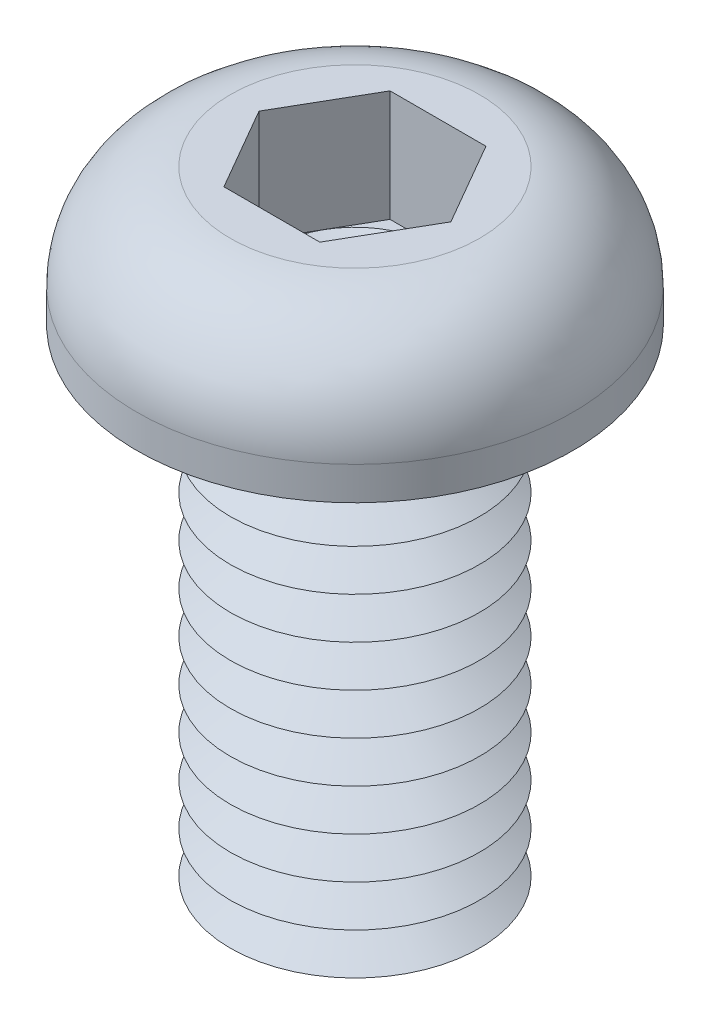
ISO-10303-21;
HEADER;
FILE_DESCRIPTION(('STEP AP214'),'2;1');
FILE_NAME('part.step','',(''),(''),'','','');
FILE_SCHEMA(('AUTOMOTIVE_DESIGN { 1 0 10303 214 1 1 1 1 }'));
ENDSEC;
DATA;
#1=APPLICATION_CONTEXT('core data for automotive mechanical design processes');
#2=APPLICATION_PROTOCOL_DEFINITION('international standard','automotive_design',2000,#1);
#3=PRODUCT_CONTEXT('',#1,'mechanical');
#4=PRODUCT('Part','Part','',(#3));
#5=PRODUCT_RELATED_PRODUCT_CATEGORY('part','',(#4));
#6=PRODUCT_DEFINITION_FORMATION('','',#4);
#7=PRODUCT_DEFINITION_CONTEXT('part definition',#1,'design');
#8=PRODUCT_DEFINITION('design','',#6,#7);
#9=PRODUCT_DEFINITION_SHAPE('','',#8);
#10=(LENGTH_UNIT() NAMED_UNIT(*) SI_UNIT(.MILLI.,.METRE.));
#11=(NAMED_UNIT(*) PLANE_ANGLE_UNIT() SI_UNIT($,.RADIAN.));
#12=(NAMED_UNIT(*) SI_UNIT($,.STERADIAN.) SOLID_ANGLE_UNIT());
#13=UNCERTAINTY_MEASURE_WITH_UNIT(LENGTH_MEASURE(1.E-05),#10,'distance_accuracy_value','');
#14=(GEOMETRIC_REPRESENTATION_CONTEXT(3) GLOBAL_UNCERTAINTY_ASSIGNED_CONTEXT((#13)) GLOBAL_UNIT_ASSIGNED_CONTEXT((#10,
#11,#12)) REPRESENTATION_CONTEXT('',''));
#15=CARTESIAN_POINT('',(0.,0.,0.));
#16=DIRECTION('',(0.,0.,1.));
#17=DIRECTION('',(1.,0.,0.));
#18=AXIS2_PLACEMENT_3D('',#15,#16,#17);
#19=CARTESIAN_POINT('',(0.,0.,0.));
#20=DIRECTION('',(0.,-1.,0.));
#21=DIRECTION('',(0.,0.,-1.));
#22=AXIS2_PLACEMENT_3D('',#19,#20,#21);
#23=TOROIDAL_SURFACE('',#22,3.5,0.5);
#24=CARTESIAN_POINT('',(0.,0.,-4.));
#25=VERTEX_POINT('',#24);
#26=VERTEX_LOOP('',#25);
#27=FACE_BOUND('',#26,.T.);
#28=ADVANCED_FACE('P0_F12',(#27),#23,.T.);
#29=CLOSED_SHELL('',(#28));
#30=MANIFOLD_SOLID_BREP('P0_B1',#29);
#31=CARTESIAN_POINT('',(1.15470053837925,0.62,-2.));
#32=DIRECTION('',(0.,1.,0.));
#33=DIRECTION('',(0.,0.,1.));
#34=AXIS2_PLACEMENT_3D('',#31,#32,#33);
#35=PLANE('',#34);
#36=CARTESIAN_POINT('',(0.,0.62,0.));
#37=DIRECTION('',(0.,1.,0.));
#38=DIRECTION('',(0.,0.,1.));
#39=AXIS2_PLACEMENT_3D('',#36,#37,#38);
#40=CIRCLE('',#39,2.);
#41=CARTESIAN_POINT('',(0.,0.62,2.));
#42=VERTEX_POINT('',#41);
#43=CARTESIAN_POINT('',(1.73205080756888,0.62,1.));
#44=VERTEX_POINT('',#43);
#45=EDGE_CURVE('P1_E93',#42,#44,#40,.T.);
#46=ORIENTED_EDGE('',*,*,#45,.F.);
#47=DIRECTION('',(1.,0.,0.));
#48=VECTOR('',#47,1.);
#49=CARTESIAN_POINT('',(-1.15470053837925,0.62,2.));
#50=LINE('',#49,#48);
#51=CARTESIAN_POINT('',(1.15470053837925,0.62,2.));
#52=VERTEX_POINT('',#51);
#53=EDGE_CURVE('P1_E116',#42,#52,#50,.T.);
#54=ORIENTED_EDGE('',*,*,#53,.T.);
#55=DIRECTION('',(0.5,0.,-0.866025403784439));
#56=VECTOR('',#55,1.);
#57=CARTESIAN_POINT('',(1.15470053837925,0.62,2.));
#58=LINE('',#57,#56);
#59=EDGE_CURVE('P1_E112',#52,#44,#58,.T.);
#60=ORIENTED_EDGE('',*,*,#59,.T.);
#61=EDGE_LOOP('',(#46,#54,#60));
#62=FACE_BOUND('',#61,.T.);
#63=ADVANCED_FACE('P1_F15',(#62),#35,.T.);
#64=CARTESIAN_POINT('',(0.,0.62,0.));
#65=DIRECTION('',(0.,1.,0.));
#66=DIRECTION('',(0.,0.,1.));
#67=AXIS2_PLACEMENT_3D('',#64,#65,#66);
#68=CIRCLE('',#67,2.);
#69=CARTESIAN_POINT('',(1.73205080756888,0.62,-1.));
#70=VERTEX_POINT('',#69);
#71=EDGE_CURVE('P1_E10',#44,#70,#68,.T.);
#72=ORIENTED_EDGE('',*,*,#71,.F.);
#73=CARTESIAN_POINT('',(2.3094010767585,0.62,0.));
#74=VERTEX_POINT('',#73);
#75=EDGE_CURVE('P1_E104',#44,#74,#58,.T.);
#76=ORIENTED_EDGE('',*,*,#75,.T.);
#77=DIRECTION('',(-0.5,0.,-0.866025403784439));
#78=VECTOR('',#77,1.);
#79=CARTESIAN_POINT('',(2.3094010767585,0.62,0.));
#80=LINE('',#79,#78);
#81=EDGE_CURVE('P1_E107',#74,#70,#80,.T.);
#82=ORIENTED_EDGE('',*,*,#81,.T.);
#83=EDGE_LOOP('',(#72,#76,#82));
#84=FACE_BOUND('',#83,.T.);
#85=ADVANCED_FACE('P1_F103',(#84),#35,.T.);
#86=CARTESIAN_POINT('',(0.,0.62,-2.));
#87=VERTEX_POINT('',#86);
#88=EDGE_CURVE('P1_E24',#70,#87,#68,.T.);
#89=ORIENTED_EDGE('',*,*,#88,.F.);
#90=CARTESIAN_POINT('',(1.15470053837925,0.62,-2.));
#91=VERTEX_POINT('',#90);
#92=EDGE_CURVE('P1_E139',#70,#91,#80,.T.);
#93=ORIENTED_EDGE('',*,*,#92,.T.);
#94=DIRECTION('',(-1.,0.,0.));
#95=VECTOR('',#94,1.);
#96=CARTESIAN_POINT('',(1.15470053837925,0.62,-2.));
#97=LINE('',#96,#95);
#98=EDGE_CURVE('P1_E288',#91,#87,#97,.T.);
#99=ORIENTED_EDGE('',*,*,#98,.T.);
#100=EDGE_LOOP('',(#89,#93,#99));
#101=FACE_BOUND('',#100,.T.);
#102=ADVANCED_FACE('P1_F253',(#101),#35,.T.);
#103=CARTESIAN_POINT('',(-1.73205080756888,0.62,-1.));
#104=VERTEX_POINT('',#103);
#105=EDGE_CURVE('P1_E283',#87,#104,#68,.T.);
#106=ORIENTED_EDGE('',*,*,#105,.F.);
#107=CARTESIAN_POINT('',(-1.15470053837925,0.62,-2.));
#108=VERTEX_POINT('',#107);
#109=EDGE_CURVE('P1_E292',#87,#108,#97,.T.);
#110=ORIENTED_EDGE('',*,*,#109,.T.);
#111=DIRECTION('',(-0.5,0.,0.866025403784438));
#112=VECTOR('',#111,1.);
#113=CARTESIAN_POINT('',(-1.15470053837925,0.62,-2.));
#114=LINE('',#113,#112);
#115=EDGE_CURVE('P1_E287',#108,#104,#114,.T.);
#116=ORIENTED_EDGE('',*,*,#115,.T.);
#117=EDGE_LOOP('',(#106,#110,#116));
#118=FACE_BOUND('',#117,.T.);
#119=ADVANCED_FACE('P1_F267',(#118),#35,.T.);
#120=CARTESIAN_POINT('',(-1.73205080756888,0.62,1.));
#121=VERTEX_POINT('',#120);
#122=EDGE_CURVE('P1_E31',#104,#121,#68,.T.);
#123=ORIENTED_EDGE('',*,*,#122,.F.);
#124=CARTESIAN_POINT('',(-2.3094010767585,0.62,0.));
#125=VERTEX_POINT('',#124);
#126=EDGE_CURVE('P1_E279',#104,#125,#114,.T.);
#127=ORIENTED_EDGE('',*,*,#126,.T.);
#128=DIRECTION('',(0.5,0.,0.866025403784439));
#129=VECTOR('',#128,1.);
#130=CARTESIAN_POINT('',(-2.3094010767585,0.62,0.));
#131=LINE('',#130,#129);
#132=EDGE_CURVE('P1_E282',#125,#121,#131,.T.);
#133=ORIENTED_EDGE('',*,*,#132,.T.);
#134=EDGE_LOOP('',(#123,#127,#133));
#135=FACE_BOUND('',#134,.T.);
#136=ADVANCED_FACE('P1_F258',(#135),#35,.T.);
#137=CARTESIAN_POINT('',(0.,-11.,0.));
#138=DIRECTION('',(0.,1.,0.));
#139=DIRECTION('',(0.,0.,1.));
#140=AXIS2_PLACEMENT_3D('',#137,#138,#139);
#141=CONICAL_SURFACE('',#140,2.13397459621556,1.0471975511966);
#142=CARTESIAN_POINT('',(0.,-10.5,0.));
#143=DIRECTION('',(0.,-1.,0.));
#144=DIRECTION('',(0.,0.,-1.));
#145=AXIS2_PLACEMENT_3D('',#142,#143,#144);
#146=CIRCLE('',#145,3.);
#147=CARTESIAN_POINT('',(0.,-10.5,-3.));
#148=VERTEX_POINT('',#147);
#149=EDGE_CURVE('P1_E215',#148,#148,#146,.T.);
#150=ORIENTED_EDGE('',*,*,#149,.T.);
#151=EDGE_LOOP('',(#150));
#152=FACE_BOUND('',#151,.T.);
#153=CARTESIAN_POINT('',(0.,-11.,0.));
#154=DIRECTION('',(0.,-1.,0.));
#155=DIRECTION('',(0.,0.,-1.));
#156=AXIS2_PLACEMENT_3D('',#153,#154,#155);
#157=CIRCLE('',#156,2.13397459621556);
#158=CARTESIAN_POINT('',(0.,-11.,-2.13397459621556));
#159=VERTEX_POINT('',#158);
#160=EDGE_CURVE('P1_E218',#159,#159,#157,.T.);
#161=ORIENTED_EDGE('',*,*,#160,.F.);
#162=EDGE_LOOP('',(#161));
#163=FACE_BOUND('',#162,.T.);
#164=ADVANCED_FACE('P1_F266',(#152,#163),#141,.T.);
#165=CARTESIAN_POINT('',(0.,-11.5,0.));
#166=DIRECTION('',(0.,-1.,0.));
#167=DIRECTION('',(0.,0.,-1.));
#168=AXIS2_PLACEMENT_3D('',#165,#166,#167);
#169=CONICAL_SURFACE('',#168,3.,1.0471975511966);
#170=ORIENTED_EDGE('',*,*,#160,.T.);
#171=EDGE_LOOP('',(#170));
#172=FACE_BOUND('',#171,.T.);
#173=CARTESIAN_POINT('',(0.,-11.5,0.));
#174=DIRECTION('',(0.,-1.,0.));
#175=DIRECTION('',(0.,0.,-1.));
#176=AXIS2_PLACEMENT_3D('',#173,#174,#175);
#177=CIRCLE('',#176,3.);
#178=CARTESIAN_POINT('',(0.,-11.5,-3.));
#179=VERTEX_POINT('',#178);
#180=EDGE_CURVE('P1_E221',#179,#179,#177,.T.);
#181=ORIENTED_EDGE('',*,*,#180,.F.);
#182=EDGE_LOOP('',(#181));
#183=FACE_BOUND('',#182,.T.);
#184=ADVANCED_FACE('P1_F273',(#172,#183),#169,.T.);
#185=CARTESIAN_POINT('',(0.,-12.,0.));
#186=DIRECTION('',(0.,1.,0.));
#187=DIRECTION('',(0.,0.,1.));
#188=AXIS2_PLACEMENT_3D('',#185,#186,#187);
#189=PLANE('',#188);
#190=CARTESIAN_POINT('',(0.,-12.,0.));
#191=DIRECTION('',(0.,-1.,0.));
#192=DIRECTION('',(0.,0.,-1.));
#193=AXIS2_PLACEMENT_3D('',#190,#191,#192);
#194=CIRCLE('',#193,2.13397459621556);
#195=CARTESIAN_POINT('',(0.,-12.,-2.13397459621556));
#196=VERTEX_POINT('',#195);
#197=EDGE_CURVE('P1_E224',#196,#196,#194,.T.);
#198=ORIENTED_EDGE('',*,*,#197,.T.);
#199=EDGE_LOOP('',(#198));
#200=FACE_BOUND('',#199,.T.);
#201=ADVANCED_FACE('P1_F351',(#200),#189,.F.);
#202=CARTESIAN_POINT('',(0.,-12.,0.));
#203=DIRECTION('',(0.,1.,0.));
#204=DIRECTION('',(0.,0.,1.));
#205=AXIS2_PLACEMENT_3D('',#202,#203,#204);
#206=CONICAL_SURFACE('',#205,2.13397459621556,1.0471975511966);
#207=ORIENTED_EDGE('',*,*,#180,.T.);
#208=EDGE_LOOP('',(#207));
#209=FACE_BOUND('',#208,.T.);
#210=ORIENTED_EDGE('',*,*,#197,.F.);
#211=EDGE_LOOP('',(#210));
#212=FACE_BOUND('',#211,.T.);
#213=ADVANCED_FACE('P1_F362',(#209,#212),#206,.T.);
#214=CARTESIAN_POINT('',(0.,-10.,0.));
#215=DIRECTION('',(0.,1.,0.));
#216=DIRECTION('',(0.,0.,1.));
#217=AXIS2_PLACEMENT_3D('',#214,#215,#216);
#218=CONICAL_SURFACE('',#217,2.13397459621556,1.0471975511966);
#219=CARTESIAN_POINT('',(0.,-9.5,0.));
#220=DIRECTION('',(0.,-1.,0.));
#221=DIRECTION('',(0.,0.,-1.));
#222=AXIS2_PLACEMENT_3D('',#219,#220,#221);
#223=CIRCLE('',#222,3.);
#224=CARTESIAN_POINT('',(0.,-9.5,-3.));
#225=VERTEX_POINT('',#224);
#226=EDGE_CURVE('P1_E209',#225,#225,#223,.T.);
#227=ORIENTED_EDGE('',*,*,#226,.T.);
#228=EDGE_LOOP('',(#227));
#229=FACE_BOUND('',#228,.T.);
#230=CARTESIAN_POINT('',(0.,-10.,0.));
#231=DIRECTION('',(0.,-1.,0.));
#232=DIRECTION('',(0.,0.,-1.));
#233=AXIS2_PLACEMENT_3D('',#230,#231,#232);
#234=CIRCLE('',#233,2.13397459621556);
#235=CARTESIAN_POINT('',(0.,-10.,-2.13397459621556));
#236=VERTEX_POINT('',#235);
#237=EDGE_CURVE('P1_E212',#236,#236,#234,.T.);
#238=ORIENTED_EDGE('',*,*,#237,.F.);
#239=EDGE_LOOP('',(#238));
#240=FACE_BOUND('',#239,.T.);
#241=ADVANCED_FACE('P1_F371',(#229,#240),#218,.T.);
#242=CARTESIAN_POINT('',(0.,-10.5,0.));
#243=DIRECTION('',(0.,-1.,0.));
#244=DIRECTION('',(0.,0.,-1.));
#245=AXIS2_PLACEMENT_3D('',#242,#243,#244);
#246=CONICAL_SURFACE('',#245,3.,1.0471975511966);
#247=ORIENTED_EDGE('',*,*,#237,.T.);
#248=EDGE_LOOP('',(#247));
#249=FACE_BOUND('',#248,.T.);
#250=ORIENTED_EDGE('',*,*,#149,.F.);
#251=EDGE_LOOP('',(#250));
#252=FACE_BOUND('',#251,.T.);
#253=ADVANCED_FACE('P1_F380',(#249,#252),#246,.T.);
#254=CARTESIAN_POINT('',(0.,-9.,0.));
#255=DIRECTION('',(0.,1.,0.));
#256=DIRECTION('',(0.,0.,1.));
#257=AXIS2_PLACEMENT_3D('',#254,#255,#256);
#258=CONICAL_SURFACE('',#257,2.13397459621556,1.0471975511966);
#259=CARTESIAN_POINT('',(0.,-8.5,0.));
#260=DIRECTION('',(0.,-1.,0.));
#261=DIRECTION('',(0.,0.,-1.));
#262=AXIS2_PLACEMENT_3D('',#259,#260,#261);
#263=CIRCLE('',#262,3.);
#264=CARTESIAN_POINT('',(0.,-8.5,-3.));
#265=VERTEX_POINT('',#264);
#266=EDGE_CURVE('P1_E203',#265,#265,#263,.T.);
#267=ORIENTED_EDGE('',*,*,#266,.T.);
#268=EDGE_LOOP('',(#267));
#269=FACE_BOUND('',#268,.T.);
#270=CARTESIAN_POINT('',(0.,-9.,0.));
#271=DIRECTION('',(0.,-1.,0.));
#272=DIRECTION('',(0.,0.,-1.));
#273=AXIS2_PLACEMENT_3D('',#270,#271,#272);
#274=CIRCLE('',#273,2.13397459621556);
#275=CARTESIAN_POINT('',(0.,-9.,-2.13397459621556));
#276=VERTEX_POINT('',#275);
#277=EDGE_CURVE('P1_E206',#276,#276,#274,.T.);
#278=ORIENTED_EDGE('',*,*,#277,.F.);
#279=EDGE_LOOP('',(#278));
#280=FACE_BOUND('',#279,.T.);
#281=ADVANCED_FACE('P1_F390',(#269,#280),#258,.T.);
#282=CARTESIAN_POINT('',(0.,-9.5,0.));
#283=DIRECTION('',(0.,-1.,0.));
#284=DIRECTION('',(0.,0.,-1.));
#285=AXIS2_PLACEMENT_3D('',#282,#283,#284);
#286=CONICAL_SURFACE('',#285,3.,1.0471975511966);
#287=ORIENTED_EDGE('',*,*,#277,.T.);
#288=EDGE_LOOP('',(#287));
#289=FACE_BOUND('',#288,.T.);
#290=ORIENTED_EDGE('',*,*,#226,.F.);
#291=EDGE_LOOP('',(#290));
#292=FACE_BOUND('',#291,.T.);
#293=ADVANCED_FACE('P1_F400',(#289,#292),#286,.T.);
#294=CARTESIAN_POINT('',(0.,-8.,0.));
#295=DIRECTION('',(0.,1.,0.));
#296=DIRECTION('',(0.,0.,1.));
#297=AXIS2_PLACEMENT_3D('',#294,#295,#296);
#298=CONICAL_SURFACE('',#297,2.13397459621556,1.0471975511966);
#299=CARTESIAN_POINT('',(0.,-7.5,0.));
#300=DIRECTION('',(0.,-1.,0.));
#301=DIRECTION('',(0.,0.,-1.));
#302=AXIS2_PLACEMENT_3D('',#299,#300,#301);
#303=CIRCLE('',#302,3.);
#304=CARTESIAN_POINT('',(0.,-7.5,-3.));
#305=VERTEX_POINT('',#304);
#306=EDGE_CURVE('P1_E197',#305,#305,#303,.T.);
#307=ORIENTED_EDGE('',*,*,#306,.T.);
#308=EDGE_LOOP('',(#307));
#309=FACE_BOUND('',#308,.T.);
#310=CARTESIAN_POINT('',(0.,-8.,0.));
#311=DIRECTION('',(0.,-1.,0.));
#312=DIRECTION('',(0.,0.,-1.));
#313=AXIS2_PLACEMENT_3D('',#310,#311,#312);
#314=CIRCLE('',#313,2.13397459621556);
#315=CARTESIAN_POINT('',(0.,-8.,-2.13397459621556));
#316=VERTEX_POINT('',#315);
#317=EDGE_CURVE('P1_E200',#316,#316,#314,.T.);
#318=ORIENTED_EDGE('',*,*,#317,.F.);
#319=EDGE_LOOP('',(#318));
#320=FACE_BOUND('',#319,.T.);
#321=ADVANCED_FACE('P1_F410',(#309,#320),#298,.T.);
#322=CARTESIAN_POINT('',(0.,-8.5,0.));
#323=DIRECTION('',(0.,-1.,0.));
#324=DIRECTION('',(0.,0.,-1.));
#325=AXIS2_PLACEMENT_3D('',#322,#323,#324);
#326=CONICAL_SURFACE('',#325,3.,1.0471975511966);
#327=ORIENTED_EDGE('',*,*,#317,.T.);
#328=EDGE_LOOP('',(#327));
#329=FACE_BOUND('',#328,.T.);
#330=ORIENTED_EDGE('',*,*,#266,.F.);
#331=EDGE_LOOP('',(#330));
#332=FACE_BOUND('',#331,.T.);
#333=ADVANCED_FACE('P1_F420',(#329,#332),#326,.T.);
#334=CARTESIAN_POINT('',(0.,-7.,0.));
#335=DIRECTION('',(0.,1.,0.));
#336=DIRECTION('',(0.,0.,1.));
#337=AXIS2_PLACEMENT_3D('',#334,#335,#336);
#338=CONICAL_SURFACE('',#337,2.13397459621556,1.0471975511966);
#339=CARTESIAN_POINT('',(0.,-6.5,0.));
#340=DIRECTION('',(0.,-1.,0.));
#341=DIRECTION('',(0.,0.,-1.));
#342=AXIS2_PLACEMENT_3D('',#339,#340,#341);
#343=CIRCLE('',#342,3.);
#344=CARTESIAN_POINT('',(0.,-6.5,-3.));
#345=VERTEX_POINT('',#344);
#346=EDGE_CURVE('P1_E191',#345,#345,#343,.T.);
#347=ORIENTED_EDGE('',*,*,#346,.T.);
#348=EDGE_LOOP('',(#347));
#349=FACE_BOUND('',#348,.T.);
#350=CARTESIAN_POINT('',(0.,-7.,0.));
#351=DIRECTION('',(0.,-1.,0.));
#352=DIRECTION('',(0.,0.,-1.));
#353=AXIS2_PLACEMENT_3D('',#350,#351,#352);
#354=CIRCLE('',#353,2.13397459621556);
#355=CARTESIAN_POINT('',(0.,-7.,-2.13397459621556));
#356=VERTEX_POINT('',#355);
#357=EDGE_CURVE('P1_E194',#356,#356,#354,.T.);
#358=ORIENTED_EDGE('',*,*,#357,.F.);
#359=EDGE_LOOP('',(#358));
#360=FACE_BOUND('',#359,.T.);
#361=ADVANCED_FACE('P1_F430',(#349,#360),#338,.T.);
#362=CARTESIAN_POINT('',(0.,-7.5,0.));
#363=DIRECTION('',(0.,-1.,0.));
#364=DIRECTION('',(0.,0.,-1.));
#365=AXIS2_PLACEMENT_3D('',#362,#363,#364);
#366=CONICAL_SURFACE('',#365,3.,1.0471975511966);
#367=ORIENTED_EDGE('',*,*,#357,.T.);
#368=EDGE_LOOP('',(#367));
#369=FACE_BOUND('',#368,.T.);
#370=ORIENTED_EDGE('',*,*,#306,.F.);
#371=EDGE_LOOP('',(#370));
#372=FACE_BOUND('',#371,.T.);
#373=ADVANCED_FACE('P1_F440',(#369,#372),#366,.T.);
#374=CARTESIAN_POINT('',(0.,-6.,0.));
#375=DIRECTION('',(0.,1.,0.));
#376=DIRECTION('',(0.,0.,1.));
#377=AXIS2_PLACEMENT_3D('',#374,#375,#376);
#378=CONICAL_SURFACE('',#377,2.13397459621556,1.0471975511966);
#379=CARTESIAN_POINT('',(0.,-5.5,0.));
#380=DIRECTION('',(0.,-1.,0.));
#381=DIRECTION('',(0.,0.,-1.));
#382=AXIS2_PLACEMENT_3D('',#379,#380,#381);
#383=CIRCLE('',#382,3.);
#384=CARTESIAN_POINT('',(0.,-5.5,-3.));
#385=VERTEX_POINT('',#384);
#386=EDGE_CURVE('P1_E185',#385,#385,#383,.T.);
#387=ORIENTED_EDGE('',*,*,#386,.T.);
#388=EDGE_LOOP('',(#387));
#389=FACE_BOUND('',#388,.T.);
#390=CARTESIAN_POINT('',(0.,-6.,0.));
#391=DIRECTION('',(0.,-1.,0.));
#392=DIRECTION('',(0.,0.,-1.));
#393=AXIS2_PLACEMENT_3D('',#390,#391,#392);
#394=CIRCLE('',#393,2.13397459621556);
#395=CARTESIAN_POINT('',(0.,-6.,-2.13397459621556));
#396=VERTEX_POINT('',#395);
#397=EDGE_CURVE('P1_E188',#396,#396,#394,.T.);
#398=ORIENTED_EDGE('',*,*,#397,.F.);
#399=EDGE_LOOP('',(#398));
#400=FACE_BOUND('',#399,.T.);
#401=ADVANCED_FACE('P1_F450',(#389,#400),#378,.T.);
#402=CARTESIAN_POINT('',(0.,-6.5,0.));
#403=DIRECTION('',(0.,-1.,0.));
#404=DIRECTION('',(0.,0.,-1.));
#405=AXIS2_PLACEMENT_3D('',#402,#403,#404);
#406=CONICAL_SURFACE('',#405,3.,1.0471975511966);
#407=ORIENTED_EDGE('',*,*,#397,.T.);
#408=EDGE_LOOP('',(#407));
#409=FACE_BOUND('',#408,.T.);
#410=ORIENTED_EDGE('',*,*,#346,.F.);
#411=EDGE_LOOP('',(#410));
#412=FACE_BOUND('',#411,.T.);
#413=ADVANCED_FACE('P1_F460',(#409,#412),#406,.T.);
#414=CARTESIAN_POINT('',(0.,-5.,0.));
#415=DIRECTION('',(0.,1.,0.));
#416=DIRECTION('',(0.,0.,1.));
#417=AXIS2_PLACEMENT_3D('',#414,#415,#416);
#418=CONICAL_SURFACE('',#417,2.13397459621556,1.0471975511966);
#419=CARTESIAN_POINT('',(0.,-4.5,0.));
#420=DIRECTION('',(0.,-1.,0.));
#421=DIRECTION('',(0.,0.,-1.));
#422=AXIS2_PLACEMENT_3D('',#419,#420,#421);
#423=CIRCLE('',#422,3.);
#424=CARTESIAN_POINT('',(0.,-4.5,-3.));
#425=VERTEX_POINT('',#424);
#426=EDGE_CURVE('P1_E179',#425,#425,#423,.T.);
#427=ORIENTED_EDGE('',*,*,#426,.T.);
#428=EDGE_LOOP('',(#427));
#429=FACE_BOUND('',#428,.T.);
#430=CARTESIAN_POINT('',(0.,-5.,0.));
#431=DIRECTION('',(0.,-1.,0.));
#432=DIRECTION('',(0.,0.,-1.));
#433=AXIS2_PLACEMENT_3D('',#430,#431,#432);
#434=CIRCLE('',#433,2.13397459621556);
#435=CARTESIAN_POINT('',(0.,-5.,-2.13397459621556));
#436=VERTEX_POINT('',#435);
#437=EDGE_CURVE('P1_E182',#436,#436,#434,.T.);
#438=ORIENTED_EDGE('',*,*,#437,.F.);
#439=EDGE_LOOP('',(#438));
#440=FACE_BOUND('',#439,.T.);
#441=ADVANCED_FACE('P1_F470',(#429,#440),#418,.T.);
#442=CARTESIAN_POINT('',(0.,-5.5,0.));
#443=DIRECTION('',(0.,-1.,0.));
#444=DIRECTION('',(0.,0.,-1.));
#445=AXIS2_PLACEMENT_3D('',#442,#443,#444);
#446=CONICAL_SURFACE('',#445,3.,1.0471975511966);
#447=ORIENTED_EDGE('',*,*,#437,.T.);
#448=EDGE_LOOP('',(#447));
#449=FACE_BOUND('',#448,.T.);
#450=ORIENTED_EDGE('',*,*,#386,.F.);
#451=EDGE_LOOP('',(#450));
#452=FACE_BOUND('',#451,.T.);
#453=ADVANCED_FACE('P1_F480',(#449,#452),#446,.T.);
#454=CARTESIAN_POINT('',(0.,-4.,0.));
#455=DIRECTION('',(0.,1.,0.));
#456=DIRECTION('',(0.,0.,1.));
#457=AXIS2_PLACEMENT_3D('',#454,#455,#456);
#458=CONICAL_SURFACE('',#457,2.13397459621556,1.0471975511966);
#459=CARTESIAN_POINT('',(0.,-3.5,0.));
#460=DIRECTION('',(0.,-1.,0.));
#461=DIRECTION('',(0.,0.,-1.));
#462=AXIS2_PLACEMENT_3D('',#459,#460,#461);
#463=CIRCLE('',#462,3.);
#464=CARTESIAN_POINT('',(0.,-3.5,-3.));
#465=VERTEX_POINT('',#464);
#466=EDGE_CURVE('P1_E173',#465,#465,#463,.T.);
#467=ORIENTED_EDGE('',*,*,#466,.T.);
#468=EDGE_LOOP('',(#467));
#469=FACE_BOUND('',#468,.T.);
#470=CARTESIAN_POINT('',(0.,-4.,0.));
#471=DIRECTION('',(0.,-1.,0.));
#472=DIRECTION('',(0.,0.,-1.));
#473=AXIS2_PLACEMENT_3D('',#470,#471,#472);
#474=CIRCLE('',#473,2.13397459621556);
#475=CARTESIAN_POINT('',(0.,-4.,-2.13397459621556));
#476=VERTEX_POINT('',#475);
#477=EDGE_CURVE('P1_E176',#476,#476,#474,.T.);
#478=ORIENTED_EDGE('',*,*,#477,.F.);
#479=EDGE_LOOP('',(#478));
#480=FACE_BOUND('',#479,.T.);
#481=ADVANCED_FACE('P1_F490',(#469,#480),#458,.T.);
#482=CARTESIAN_POINT('',(0.,-4.5,0.));
#483=DIRECTION('',(0.,-1.,0.));
#484=DIRECTION('',(0.,0.,-1.));
#485=AXIS2_PLACEMENT_3D('',#482,#483,#484);
#486=CONICAL_SURFACE('',#485,3.,1.0471975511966);
#487=ORIENTED_EDGE('',*,*,#477,.T.);
#488=EDGE_LOOP('',(#487));
#489=FACE_BOUND('',#488,.T.);
#490=ORIENTED_EDGE('',*,*,#426,.F.);
#491=EDGE_LOOP('',(#490));
#492=FACE_BOUND('',#491,.T.);
#493=ADVANCED_FACE('P1_F500',(#489,#492),#486,.T.);
#494=CARTESIAN_POINT('',(0.,-3.,0.));
#495=DIRECTION('',(0.,1.,0.));
#496=DIRECTION('',(0.,0.,1.));
#497=AXIS2_PLACEMENT_3D('',#494,#495,#496);
#498=CONICAL_SURFACE('',#497,2.13397459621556,1.0471975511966);
#499=CARTESIAN_POINT('',(0.,-2.5,0.));
#500=DIRECTION('',(0.,-1.,0.));
#501=DIRECTION('',(0.,0.,-1.));
#502=AXIS2_PLACEMENT_3D('',#499,#500,#501);
#503=CIRCLE('',#502,3.);
#504=CARTESIAN_POINT('',(0.,-2.5,-3.));
#505=VERTEX_POINT('',#504);
#506=EDGE_CURVE('P1_E164',#505,#505,#503,.T.);
#507=ORIENTED_EDGE('',*,*,#506,.T.);
#508=EDGE_LOOP('',(#507));
#509=FACE_BOUND('',#508,.T.);
#510=CARTESIAN_POINT('',(0.,-3.,0.));
#511=DIRECTION('',(0.,-1.,0.));
#512=DIRECTION('',(0.,0.,-1.));
#513=AXIS2_PLACEMENT_3D('',#510,#511,#512);
#514=CIRCLE('',#513,2.13397459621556);
#515=CARTESIAN_POINT('',(0.,-3.,-2.13397459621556));
#516=VERTEX_POINT('',#515);
#517=EDGE_CURVE('P1_E170',#516,#516,#514,.T.);
#518=ORIENTED_EDGE('',*,*,#517,.F.);
#519=EDGE_LOOP('',(#518));
#520=FACE_BOUND('',#519,.T.);
#521=ADVANCED_FACE('P1_F510',(#509,#520),#498,.T.);
#522=CARTESIAN_POINT('',(0.,-3.5,0.));
#523=DIRECTION('',(0.,-1.,0.));
#524=DIRECTION('',(0.,0.,-1.));
#525=AXIS2_PLACEMENT_3D('',#522,#523,#524);
#526=CONICAL_SURFACE('',#525,3.,1.0471975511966);
#527=ORIENTED_EDGE('',*,*,#517,.T.);
#528=EDGE_LOOP('',(#527));
#529=FACE_BOUND('',#528,.T.);
#530=ORIENTED_EDGE('',*,*,#466,.F.);
#531=EDGE_LOOP('',(#530));
#532=FACE_BOUND('',#531,.T.);
#533=ADVANCED_FACE('P1_F520',(#529,#532),#526,.T.);
#534=CARTESIAN_POINT('',(0.,-2.,0.));
#535=DIRECTION('',(0.,1.,0.));
#536=DIRECTION('',(0.,0.,1.));
#537=AXIS2_PLACEMENT_3D('',#534,#535,#536);
#538=CONICAL_SURFACE('',#537,2.13397459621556,1.0471975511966);
#539=CARTESIAN_POINT('',(0.,-1.5,0.));
#540=DIRECTION('',(0.,-1.,0.));
#541=DIRECTION('',(0.,0.,-1.));
#542=AXIS2_PLACEMENT_3D('',#539,#540,#541);
#543=CIRCLE('',#542,3.);
#544=CARTESIAN_POINT('',(0.,-1.5,-3.));
#545=VERTEX_POINT('',#544);
#546=EDGE_CURVE('P1_E167',#545,#545,#543,.T.);
#547=ORIENTED_EDGE('',*,*,#546,.T.);
#548=EDGE_LOOP('',(#547));
#549=FACE_BOUND('',#548,.T.);
#550=CARTESIAN_POINT('',(0.,-2.,0.));
#551=DIRECTION('',(0.,-1.,0.));
#552=DIRECTION('',(0.,0.,-1.));
#553=AXIS2_PLACEMENT_3D('',#550,#551,#552);
#554=CIRCLE('',#553,2.13397459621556);
#555=CARTESIAN_POINT('',(0.,-2.,-2.13397459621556));
#556=VERTEX_POINT('',#555);
#557=EDGE_CURVE('P1_E161',#556,#556,#554,.T.);
#558=ORIENTED_EDGE('',*,*,#557,.F.);
#559=EDGE_LOOP('',(#558));
#560=FACE_BOUND('',#559,.T.);
#561=ADVANCED_FACE('P1_F530',(#549,#560),#538,.T.);
#562=CARTESIAN_POINT('',(0.,-2.5,0.));
#563=DIRECTION('',(0.,-1.,0.));
#564=DIRECTION('',(0.,0.,-1.));
#565=AXIS2_PLACEMENT_3D('',#562,#563,#564);
#566=CONICAL_SURFACE('',#565,3.,1.0471975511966);
#567=ORIENTED_EDGE('',*,*,#557,.T.);
#568=EDGE_LOOP('',(#567));
#569=FACE_BOUND('',#568,.T.);
#570=ORIENTED_EDGE('',*,*,#506,.F.);
#571=EDGE_LOOP('',(#570));
#572=FACE_BOUND('',#571,.T.);
#573=ADVANCED_FACE('P1_F540',(#569,#572),#566,.T.);
#574=CARTESIAN_POINT('',(0.,-12.,0.));
#575=DIRECTION('',(0.,1.,0.));
#576=DIRECTION('',(0.,0.,1.));
#577=AXIS2_PLACEMENT_3D('',#574,#575,#576);
#578=CYLINDRICAL_SURFACE('',#577,3.);
#579=CARTESIAN_POINT('',(0.,0.,0.));
#580=DIRECTION('',(0.,-1.,0.));
#581=DIRECTION('',(1.,0.,0.));
#582=AXIS2_PLACEMENT_3D('',#579,#580,#581);
#583=CIRCLE('',#582,3.);
#584=CARTESIAN_POINT('',(3.,0.,0.));
#585=VERTEX_POINT('',#584);
#586=EDGE_CURVE('P1_E141',#585,#585,#583,.F.);
#587=ORIENTED_EDGE('',*,*,#586,.F.);
#588=EDGE_LOOP('',(#587));
#589=FACE_BOUND('',#588,.T.);
#590=ORIENTED_EDGE('',*,*,#546,.F.);
#591=EDGE_LOOP('',(#590));
#592=FACE_BOUND('',#591,.T.);
#593=ADVANCED_FACE('P1_F17',(#589,#592),#578,.T.);
#594=CARTESIAN_POINT('',(0.,0.,0.));
#595=DIRECTION('',(0.,-1.,0.));
#596=DIRECTION('',(0.,0.,-1.));
#597=AXIS2_PLACEMENT_3D('',#594,#595,#596);
#598=TOROIDAL_SURFACE('',#597,3.5,0.5);
#599=ORIENTED_EDGE('',*,*,#586,.T.);
#600=EDGE_LOOP('',(#599));
#601=FACE_BOUND('',#600,.T.);
#602=CARTESIAN_POINT('',(0.,0.,0.));
#603=DIRECTION('',(0.,1.,0.));
#604=DIRECTION('',(-1.,0.,0.));
#605=AXIS2_PLACEMENT_3D('',#602,#603,#604);
#606=CIRCLE('',#605,4.);
#607=CARTESIAN_POINT('',(-4.,0.,0.));
#608=VERTEX_POINT('',#607);
#609=EDGE_CURVE('P1_E151',#608,#608,#606,.F.);
#610=ORIENTED_EDGE('',*,*,#609,.T.);
#611=EDGE_LOOP('',(#610));
#612=FACE_BOUND('',#611,.T.);
#613=ADVANCED_FACE('P1_F229',(#601,#612),#598,.F.);
#614=CARTESIAN_POINT('',(3.,3.3,0.));
#615=DIRECTION('',(0.,-1.,0.));
#616=DIRECTION('',(1.,0.,0.));
#617=AXIS2_PLACEMENT_3D('',#614,#615,#616);
#618=PLANE('',#617);
#619=DIRECTION('',(-1.,0.,0.));
#620=VECTOR('',#619,1.);
#621=CARTESIAN_POINT('',(1.15470053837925,3.3,-2.));
#622=LINE('',#621,#620);
#623=CARTESIAN_POINT('',(1.15470053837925,3.3,-2.));
#624=VERTEX_POINT('',#623);
#625=CARTESIAN_POINT('',(-1.15470053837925,3.3,-2.));
#626=VERTEX_POINT('',#625);
#627=EDGE_CURVE('P1_E125',#624,#626,#622,.T.);
#628=ORIENTED_EDGE('',*,*,#627,.F.);
#629=DIRECTION('',(-0.5,0.,-0.866025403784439));
#630=VECTOR('',#629,1.);
#631=CARTESIAN_POINT('',(2.3094010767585,3.3,0.));
#632=LINE('',#631,#630);
#633=CARTESIAN_POINT('',(2.3094010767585,3.3,0.));
#634=VERTEX_POINT('',#633);
#635=EDGE_CURVE('P1_E39',#634,#624,#632,.T.);
#636=ORIENTED_EDGE('',*,*,#635,.F.);
#637=DIRECTION('',(0.5,0.,-0.866025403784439));
#638=VECTOR('',#637,1.);
#639=CARTESIAN_POINT('',(1.15470053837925,3.3,2.));
#640=LINE('',#639,#638);
#641=CARTESIAN_POINT('',(1.15470053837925,3.3,2.));
#642=VERTEX_POINT('',#641);
#643=EDGE_CURVE('P1_E137',#642,#634,#640,.T.);
#644=ORIENTED_EDGE('',*,*,#643,.F.);
#645=DIRECTION('',(1.,0.,0.));
#646=VECTOR('',#645,1.);
#647=CARTESIAN_POINT('',(-1.15470053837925,3.3,2.));
#648=LINE('',#647,#646);
#649=CARTESIAN_POINT('',(-1.15470053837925,3.3,2.));
#650=VERTEX_POINT('',#649);
#651=EDGE_CURVE('P1_E134',#650,#642,#648,.T.);
#652=ORIENTED_EDGE('',*,*,#651,.F.);
#653=DIRECTION('',(0.5,0.,0.866025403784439));
#654=VECTOR('',#653,1.);
#655=CARTESIAN_POINT('',(-2.3094010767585,3.3,0.));
#656=LINE('',#655,#654);
#657=CARTESIAN_POINT('',(-2.3094010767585,3.3,0.));
#658=VERTEX_POINT('',#657);
#659=EDGE_CURVE('P1_E131',#658,#650,#656,.T.);
#660=ORIENTED_EDGE('',*,*,#659,.F.);
#661=DIRECTION('',(-0.5,0.,0.866025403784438));
#662=VECTOR('',#661,1.);
#663=CARTESIAN_POINT('',(-1.15470053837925,3.3,-2.));
#664=LINE('',#663,#662);
#665=EDGE_CURVE('P1_E128',#626,#658,#664,.T.);
#666=ORIENTED_EDGE('',*,*,#665,.F.);
#667=EDGE_LOOP('',(#628,#636,#644,#652,#660,#666));
#668=FACE_BOUND('',#667,.T.);
#669=CARTESIAN_POINT('',(0.,3.3,0.));
#670=DIRECTION('',(0.,1.,0.));
#671=DIRECTION('',(-1.,0.,0.));
#672=AXIS2_PLACEMENT_3D('',#669,#670,#671);
#673=CIRCLE('',#672,3.);
#674=CARTESIAN_POINT('',(-3.,3.3,0.));
#675=VERTEX_POINT('',#674);
#676=EDGE_CURVE('P1_E152',#675,#675,#673,.T.);
#677=ORIENTED_EDGE('',*,*,#676,.T.);
#678=EDGE_LOOP('',(#677));
#679=FACE_BOUND('',#678,.T.);
#680=ADVANCED_FACE('P1_F307',(#668,#679),#618,.F.);
#681=CARTESIAN_POINT('',(0.,0.8,0.));
#682=DIRECTION('',(0.,1.,0.));
#683=DIRECTION('',(-1.,0.,0.));
#684=AXIS2_PLACEMENT_3D('',#681,#682,#683);
#685=TOROIDAL_SURFACE('',#684,2.73611111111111,2.51388888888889);
#686=ORIENTED_EDGE('',*,*,#676,.F.);
#687=EDGE_LOOP('',(#686));
#688=FACE_BOUND('',#687,.T.);
#689=CARTESIAN_POINT('',(0.,0.8,0.));
#690=DIRECTION('',(0.,1.,0.));
#691=DIRECTION('',(-1.,0.,0.));
#692=AXIS2_PLACEMENT_3D('',#689,#690,#691);
#693=CIRCLE('',#692,5.25);
#694=CARTESIAN_POINT('',(-5.25,0.8,0.));
#695=VERTEX_POINT('',#694);
#696=EDGE_CURVE('P1_E155',#695,#695,#693,.T.);
#697=ORIENTED_EDGE('',*,*,#696,.T.);
#698=EDGE_LOOP('',(#697));
#699=FACE_BOUND('',#698,.T.);
#700=ADVANCED_FACE('P1_F243',(#688,#699),#685,.T.);
#701=CARTESIAN_POINT('',(0.,3.3,0.));
#702=DIRECTION('',(0.,1.,0.));
#703=DIRECTION('',(-1.,0.,0.));
#704=AXIS2_PLACEMENT_3D('',#701,#702,#703);
#705=CYLINDRICAL_SURFACE('',#704,5.25);
#706=ORIENTED_EDGE('',*,*,#696,.F.);
#707=EDGE_LOOP('',(#706));
#708=FACE_BOUND('',#707,.T.);
#709=CARTESIAN_POINT('',(0.,0.,0.));
#710=DIRECTION('',(0.,1.,0.));
#711=DIRECTION('',(-1.,0.,0.));
#712=AXIS2_PLACEMENT_3D('',#709,#710,#711);
#713=CIRCLE('',#712,5.25);
#714=CARTESIAN_POINT('',(-5.25,0.,0.));
#715=VERTEX_POINT('',#714);
#716=EDGE_CURVE('P1_E158',#715,#715,#713,.T.);
#717=ORIENTED_EDGE('',*,*,#716,.T.);
#718=EDGE_LOOP('',(#717));
#719=FACE_BOUND('',#718,.T.);
#720=ADVANCED_FACE('P1_F234',(#708,#719),#705,.T.);
#721=CARTESIAN_POINT('',(0.,0.,0.));
#722=DIRECTION('',(0.,1.,0.));
#723=DIRECTION('',(-1.,0.,0.));
#724=AXIS2_PLACEMENT_3D('',#721,#722,#723);
#725=PLANE('',#724);
#726=ORIENTED_EDGE('',*,*,#716,.F.);
#727=EDGE_LOOP('',(#726));
#728=FACE_BOUND('',#727,.T.);
#729=ORIENTED_EDGE('',*,*,#609,.F.);
#730=EDGE_LOOP('',(#729));
#731=FACE_BOUND('',#730,.T.);
#732=ADVANCED_FACE('P1_F231',(#728,#731),#725,.F.);
#733=CARTESIAN_POINT('',(2.3094010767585,0.62,0.));
#734=DIRECTION('',(0.866025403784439,0.,-0.5));
#735=DIRECTION('',(-0.5,0.,-0.866025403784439));
#736=AXIS2_PLACEMENT_3D('',#733,#734,#735);
#737=PLANE('',#736);
#738=ORIENTED_EDGE('',*,*,#635,.T.);
#739=DIRECTION('',(0.,1.,0.));
#740=VECTOR('',#739,1.);
#741=CARTESIAN_POINT('',(1.15470053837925,0.62,-2.));
#742=LINE('',#741,#740);
#743=EDGE_CURVE('P1_E118',#91,#624,#742,.T.);
#744=ORIENTED_EDGE('',*,*,#743,.F.);
#745=ORIENTED_EDGE('',*,*,#92,.F.);
#746=ORIENTED_EDGE('',*,*,#81,.F.);
#747=DIRECTION('',(0.,1.,0.));
#748=VECTOR('',#747,1.);
#749=CARTESIAN_POINT('',(2.3094010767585,0.62,0.));
#750=LINE('',#749,#748);
#751=EDGE_CURVE('P1_E113',#74,#634,#750,.T.);
#752=ORIENTED_EDGE('',*,*,#751,.T.);
#753=EDGE_LOOP('',(#738,#744,#745,#746,#752));
#754=FACE_BOUND('',#753,.T.);
#755=ADVANCED_FACE('P1_F233',(#754),#737,.F.);
#756=CARTESIAN_POINT('',(1.15470053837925,0.62,2.));
#757=DIRECTION('',(0.866025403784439,0.,0.5));
#758=DIRECTION('',(0.5,0.,-0.866025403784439));
#759=AXIS2_PLACEMENT_3D('',#756,#757,#758);
#760=PLANE('',#759);
#761=ORIENTED_EDGE('',*,*,#643,.T.);
#762=ORIENTED_EDGE('',*,*,#751,.F.);
#763=ORIENTED_EDGE('',*,*,#75,.F.);
#764=ORIENTED_EDGE('',*,*,#59,.F.);
#765=DIRECTION('',(0.,1.,0.));
#766=VECTOR('',#765,1.);
#767=CARTESIAN_POINT('',(1.15470053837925,0.62,2.));
#768=LINE('',#767,#766);
#769=EDGE_CURVE('P1_E142',#52,#642,#768,.T.);
#770=ORIENTED_EDGE('',*,*,#769,.T.);
#771=EDGE_LOOP('',(#761,#762,#763,#764,#770));
#772=FACE_BOUND('',#771,.T.);
#773=ADVANCED_FACE('P1_F111',(#772),#760,.F.);
#774=CARTESIAN_POINT('',(-1.15470053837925,0.62,2.));
#775=DIRECTION('',(0.,0.,1.));
#776=DIRECTION('',(1.,0.,0.));
#777=AXIS2_PLACEMENT_3D('',#774,#775,#776);
#778=PLANE('',#777);
#779=ORIENTED_EDGE('',*,*,#651,.T.);
#780=ORIENTED_EDGE('',*,*,#769,.F.);
#781=ORIENTED_EDGE('',*,*,#53,.F.);
#782=CARTESIAN_POINT('',(-1.15470053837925,0.62,2.));
#783=VERTEX_POINT('',#782);
#784=EDGE_CURVE('P1_E114',#783,#42,#50,.T.);
#785=ORIENTED_EDGE('',*,*,#784,.F.);
#786=DIRECTION('',(0.,1.,0.));
#787=VECTOR('',#786,1.);
#788=CARTESIAN_POINT('',(-1.15470053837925,0.62,2.));
#789=LINE('',#788,#787);
#790=EDGE_CURVE('P1_E144',#783,#650,#789,.T.);
#791=ORIENTED_EDGE('',*,*,#790,.T.);
#792=EDGE_LOOP('',(#779,#780,#781,#785,#791));
#793=FACE_BOUND('',#792,.T.);
#794=ADVANCED_FACE('P1_F302',(#793),#778,.F.);
#795=CARTESIAN_POINT('',(-2.3094010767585,0.62,0.));
#796=DIRECTION('',(-0.866025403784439,0.,0.5));
#797=DIRECTION('',(0.5,0.,0.866025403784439));
#798=AXIS2_PLACEMENT_3D('',#795,#796,#797);
#799=PLANE('',#798);
#800=ORIENTED_EDGE('',*,*,#659,.T.);
#801=ORIENTED_EDGE('',*,*,#790,.F.);
#802=EDGE_CURVE('P1_E294',#121,#783,#131,.T.);
#803=ORIENTED_EDGE('',*,*,#802,.F.);
#804=ORIENTED_EDGE('',*,*,#132,.F.);
#805=DIRECTION('',(0.,1.,0.));
#806=VECTOR('',#805,1.);
#807=CARTESIAN_POINT('',(-2.3094010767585,0.62,0.));
#808=LINE('',#807,#806);
#809=EDGE_CURVE('P1_E146',#125,#658,#808,.T.);
#810=ORIENTED_EDGE('',*,*,#809,.T.);
#811=EDGE_LOOP('',(#800,#801,#803,#804,#810));
#812=FACE_BOUND('',#811,.T.);
#813=ADVANCED_FACE('P1_F618',(#812),#799,.F.);
#814=CARTESIAN_POINT('',(-1.15470053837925,0.62,-2.));
#815=DIRECTION('',(-0.866025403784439,0.,-0.5));
#816=DIRECTION('',(-0.5,0.,0.866025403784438));
#817=AXIS2_PLACEMENT_3D('',#814,#815,#816);
#818=PLANE('',#817);
#819=ORIENTED_EDGE('',*,*,#665,.T.);
#820=ORIENTED_EDGE('',*,*,#809,.F.);
#821=ORIENTED_EDGE('',*,*,#126,.F.);
#822=ORIENTED_EDGE('',*,*,#115,.F.);
#823=DIRECTION('',(0.,1.,0.));
#824=VECTOR('',#823,1.);
#825=CARTESIAN_POINT('',(-1.15470053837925,0.62,-2.));
#826=LINE('',#825,#824);
#827=EDGE_CURVE('P1_E119',#108,#626,#826,.T.);
#828=ORIENTED_EDGE('',*,*,#827,.T.);
#829=EDGE_LOOP('',(#819,#820,#821,#822,#828));
#830=FACE_BOUND('',#829,.T.);
#831=ADVANCED_FACE('P1_F262',(#830),#818,.F.);
#832=CARTESIAN_POINT('',(1.15470053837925,0.62,-2.));
#833=DIRECTION('',(0.,0.,-1.));
#834=DIRECTION('',(-1.,0.,0.));
#835=AXIS2_PLACEMENT_3D('',#832,#833,#834);
#836=PLANE('',#835);
#837=ORIENTED_EDGE('',*,*,#627,.T.);
#838=ORIENTED_EDGE('',*,*,#827,.F.);
#839=ORIENTED_EDGE('',*,*,#109,.F.);
#840=ORIENTED_EDGE('',*,*,#98,.F.);
#841=ORIENTED_EDGE('',*,*,#743,.T.);
#842=EDGE_LOOP('',(#837,#838,#839,#840,#841));
#843=FACE_BOUND('',#842,.T.);
#844=ADVANCED_FACE('P1_F256',(#843),#836,.F.);
#845=EDGE_CURVE('P1_E19',#121,#42,#68,.T.);
#846=ORIENTED_EDGE('',*,*,#845,.F.);
#847=ORIENTED_EDGE('',*,*,#802,.T.);
#848=ORIENTED_EDGE('',*,*,#784,.T.);
#849=EDGE_LOOP('',(#846,#847,#848));
#850=FACE_BOUND('',#849,.T.);
#851=ADVANCED_FACE('P1_F90',(#850),#35,.T.);
#852=CARTESIAN_POINT('',(0.,0.62,0.));
#853=DIRECTION('',(0.,1.,0.));
#854=DIRECTION('',(0.,0.,1.));
#855=AXIS2_PLACEMENT_3D('',#852,#853,#854);
#856=CONICAL_SURFACE('',#855,2.,1.0471975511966);
#857=CARTESIAN_POINT('',(0.,-0.534700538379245,0.));
#858=VERTEX_POINT('',#857);
#859=VERTEX_LOOP('',#858);
#860=FACE_BOUND('',#859,.T.);
#861=ORIENTED_EDGE('',*,*,#45,.T.);
#862=ORIENTED_EDGE('',*,*,#71,.T.);
#863=ORIENTED_EDGE('',*,*,#88,.T.);
#864=ORIENTED_EDGE('',*,*,#105,.T.);
#865=ORIENTED_EDGE('',*,*,#122,.T.);
#866=ORIENTED_EDGE('',*,*,#845,.T.);
#867=EDGE_LOOP('',(#861,#862,#863,#864,#865,#866));
#868=FACE_BOUND('',#867,.T.);
#869=ADVANCED_FACE('P1_F88',(#860,#868),#856,.F.);
#870=CLOSED_SHELL('',(#63,#85,#102,#119,#136,#164,#184,#201,#213,#241,#253,#281,#293,#321,#333,
#361,#373,#401,#413,#441,#453,#481,#493,#521,#533,#561,#573,#593,#613,#680,#700,#720,#732,#755,
#773,#794,#813,#831,#844,#851,#869));
#871=MANIFOLD_SOLID_BREP('P1_B1',#870);
#872=ADVANCED_BREP_SHAPE_REPRESENTATION('',(#18,#30,#871),#14);
#873=SHAPE_DEFINITION_REPRESENTATION(#9,#872);
ENDSEC;
END-ISO-10303-21;
